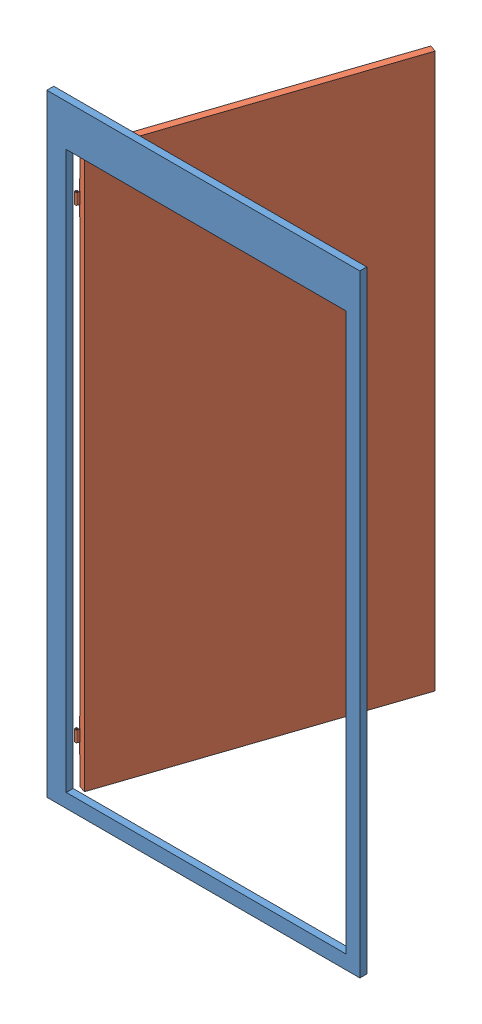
SolidWorks assembly Door.SLDASM, configuration Default (file format 11000). Lengths in mm.
Overall size (1147.5 2210 986.86).
2 component instances, 2 part files, 0 mates.
Components (placement in the parent):
- frame-1: frame.sldprt [Default] at (454.9672 -991.4037 10.0938) size (1147.5 2210 35)
- door-1: door.sldprt [Default] at (-190.7764 976.0963 -957.1207) x (0.31778 0 -0.948164) z (0.948164 0 0.31778) size (1012.5 2000 35)
